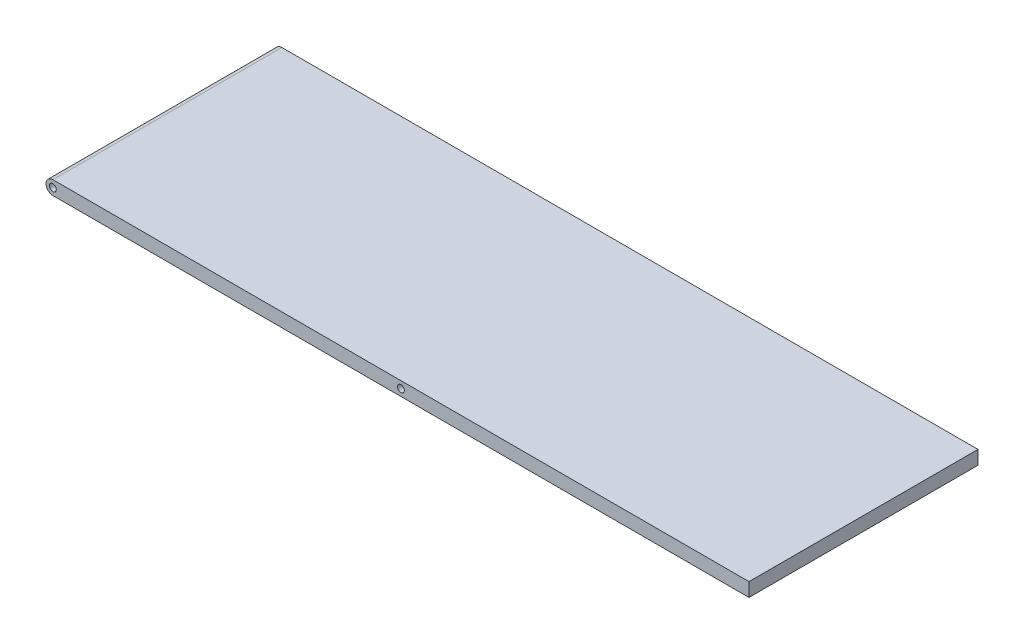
ISO-10303-21;
HEADER;
FILE_DESCRIPTION(('STEP AP214'),'2;1');
FILE_NAME('part.step','',(''),(''),'','','');
FILE_SCHEMA(('AUTOMOTIVE_DESIGN { 1 0 10303 214 1 1 1 1 }'));
ENDSEC;
DATA;
#1=APPLICATION_CONTEXT('core data for automotive mechanical design processes');
#2=APPLICATION_PROTOCOL_DEFINITION('international standard','automotive_design',2000,#1);
#3=PRODUCT_CONTEXT('',#1,'mechanical');
#4=PRODUCT('Part','Part','',(#3));
#5=PRODUCT_RELATED_PRODUCT_CATEGORY('part','',(#4));
#6=PRODUCT_DEFINITION_FORMATION('','',#4);
#7=PRODUCT_DEFINITION_CONTEXT('part definition',#1,'design');
#8=PRODUCT_DEFINITION('design','',#6,#7);
#9=PRODUCT_DEFINITION_SHAPE('','',#8);
#10=(LENGTH_UNIT() NAMED_UNIT(*) SI_UNIT(.MILLI.,.METRE.));
#11=(NAMED_UNIT(*) PLANE_ANGLE_UNIT() SI_UNIT($,.RADIAN.));
#12=(NAMED_UNIT(*) SI_UNIT($,.STERADIAN.) SOLID_ANGLE_UNIT());
#13=UNCERTAINTY_MEASURE_WITH_UNIT(LENGTH_MEASURE(1.E-05),#10,'distance_accuracy_value','');
#14=(GEOMETRIC_REPRESENTATION_CONTEXT(3) GLOBAL_UNCERTAINTY_ASSIGNED_CONTEXT((#13)) GLOBAL_UNIT_ASSIGNED_CONTEXT((#10,
#11,#12)) REPRESENTATION_CONTEXT('',''));
#15=CARTESIAN_POINT('',(0.,0.,0.));
#16=DIRECTION('',(0.,0.,1.));
#17=DIRECTION('',(1.,0.,0.));
#18=AXIS2_PLACEMENT_3D('',#15,#16,#17);
#19=CARTESIAN_POINT('',(152.,1.5,50.));
#20=DIRECTION('',(-1.,0.,0.));
#21=DIRECTION('',(0.,-1.,0.));
#22=AXIS2_PLACEMENT_3D('',#19,#20,#21);
#23=PLANE('',#22);
#24=DIRECTION('',(0.,1.,0.));
#25=VECTOR('',#24,1.);
#26=CARTESIAN_POINT('',(152.,1.5,0.));
#27=LINE('',#26,#25);
#28=CARTESIAN_POINT('',(152.,-1.50000000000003,0.));
#29=VERTEX_POINT('',#28);
#30=CARTESIAN_POINT('',(152.,1.5,0.));
#31=VERTEX_POINT('',#30);
#32=EDGE_CURVE('E75',#29,#31,#27,.T.);
#33=ORIENTED_EDGE('',*,*,#32,.T.);
#34=DIRECTION('',(0.,0.,-1.));
#35=VECTOR('',#34,1.);
#36=CARTESIAN_POINT('',(152.,1.5,50.));
#37=LINE('',#36,#35);
#38=CARTESIAN_POINT('',(152.,1.5,50.));
#39=VERTEX_POINT('',#38);
#40=EDGE_CURVE('E11',#39,#31,#37,.T.);
#41=ORIENTED_EDGE('',*,*,#40,.F.);
#42=DIRECTION('',(0.,1.,0.));
#43=VECTOR('',#42,1.);
#44=CARTESIAN_POINT('',(152.,1.5,50.));
#45=LINE('',#44,#43);
#46=CARTESIAN_POINT('',(152.,-1.50000000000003,50.));
#47=VERTEX_POINT('',#46);
#48=EDGE_CURVE('E98',#47,#39,#45,.T.);
#49=ORIENTED_EDGE('',*,*,#48,.F.);
#50=DIRECTION('',(0.,0.,-1.));
#51=VECTOR('',#50,1.);
#52=CARTESIAN_POINT('',(152.,-1.50000000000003,50.));
#53=LINE('',#52,#51);
#54=EDGE_CURVE('E87',#47,#29,#53,.T.);
#55=ORIENTED_EDGE('',*,*,#54,.T.);
#56=EDGE_LOOP('',(#33,#41,#49,#55));
#57=FACE_BOUND('',#56,.T.);
#58=ADVANCED_FACE('F31',(#57),#23,.F.);
#59=CARTESIAN_POINT('',(0.,1.5,50.));
#60=DIRECTION('',(0.,-1.,0.));
#61=DIRECTION('',(0.,0.,-1.));
#62=AXIS2_PLACEMENT_3D('',#59,#60,#61);
#63=PLANE('',#62);
#64=DIRECTION('',(-1.,0.,0.));
#65=VECTOR('',#64,1.);
#66=CARTESIAN_POINT('',(0.,1.5,0.));
#67=LINE('',#66,#65);
#68=CARTESIAN_POINT('',(0.,1.5,0.));
#69=VERTEX_POINT('',#68);
#70=EDGE_CURVE('E71',#31,#69,#67,.T.);
#71=ORIENTED_EDGE('',*,*,#70,.T.);
#72=DIRECTION('',(0.,0.,-1.));
#73=VECTOR('',#72,1.);
#74=CARTESIAN_POINT('',(0.,1.5,50.));
#75=LINE('',#74,#73);
#76=CARTESIAN_POINT('',(0.,1.5,50.));
#77=VERTEX_POINT('',#76);
#78=EDGE_CURVE('E38',#77,#69,#75,.T.);
#79=ORIENTED_EDGE('',*,*,#78,.F.);
#80=DIRECTION('',(-1.,0.,0.));
#81=VECTOR('',#80,1.);
#82=CARTESIAN_POINT('',(0.,1.5,50.));
#83=LINE('',#82,#81);
#84=EDGE_CURVE('E83',#39,#77,#83,.T.);
#85=ORIENTED_EDGE('',*,*,#84,.F.);
#86=ORIENTED_EDGE('',*,*,#40,.T.);
#87=EDGE_LOOP('',(#71,#79,#85,#86));
#88=FACE_BOUND('',#87,.T.);
#89=ADVANCED_FACE('F82',(#88),#63,.F.);
#90=CARTESIAN_POINT('',(0.,0.,50.));
#91=DIRECTION('',(0.,0.,-1.));
#92=DIRECTION('',(-1.,0.,0.));
#93=AXIS2_PLACEMENT_3D('',#90,#91,#92);
#94=CYLINDRICAL_SURFACE('',#93,1.5);
#95=CARTESIAN_POINT('',(0.,0.,0.));
#96=DIRECTION('',(0.,0.,1.));
#97=DIRECTION('',(1.,0.,0.));
#98=AXIS2_PLACEMENT_3D('',#95,#96,#97);
#99=CIRCLE('',#98,1.5);
#100=CARTESIAN_POINT('',(0.,-1.5,0.));
#101=VERTEX_POINT('',#100);
#102=EDGE_CURVE('E76',#69,#101,#99,.T.);
#103=ORIENTED_EDGE('',*,*,#102,.T.);
#104=DIRECTION('',(0.,0.,-1.));
#105=VECTOR('',#104,1.);
#106=CARTESIAN_POINT('',(0.,-1.5,50.));
#107=LINE('',#106,#105);
#108=CARTESIAN_POINT('',(0.,-1.5,50.));
#109=VERTEX_POINT('',#108);
#110=EDGE_CURVE('E104',#109,#101,#107,.T.);
#111=ORIENTED_EDGE('',*,*,#110,.F.);
#112=CARTESIAN_POINT('',(0.,0.,50.));
#113=DIRECTION('',(0.,0.,1.));
#114=DIRECTION('',(1.,0.,0.));
#115=AXIS2_PLACEMENT_3D('',#112,#113,#114);
#116=CIRCLE('',#115,1.5);
#117=EDGE_CURVE('E50',#77,#109,#116,.T.);
#118=ORIENTED_EDGE('',*,*,#117,.F.);
#119=ORIENTED_EDGE('',*,*,#78,.T.);
#120=EDGE_LOOP('',(#103,#111,#118,#119));
#121=FACE_BOUND('',#120,.T.);
#122=ADVANCED_FACE('F107',(#121),#94,.T.);
#123=CARTESIAN_POINT('',(0.,-1.5,50.));
#124=DIRECTION('',(0.,1.,0.));
#125=DIRECTION('',(-1.,0.,0.));
#126=AXIS2_PLACEMENT_3D('',#123,#124,#125);
#127=PLANE('',#126);
#128=DIRECTION('',(1.,0.,0.));
#129=VECTOR('',#128,1.);
#130=CARTESIAN_POINT('',(0.,-1.5,0.));
#131=LINE('',#130,#129);
#132=EDGE_CURVE('E96',#101,#29,#131,.T.);
#133=ORIENTED_EDGE('',*,*,#132,.T.);
#134=ORIENTED_EDGE('',*,*,#54,.F.);
#135=DIRECTION('',(1.,0.,0.));
#136=VECTOR('',#135,1.);
#137=CARTESIAN_POINT('',(0.,-1.5,50.));
#138=LINE('',#137,#136);
#139=EDGE_CURVE('E45',#109,#47,#138,.T.);
#140=ORIENTED_EDGE('',*,*,#139,.F.);
#141=ORIENTED_EDGE('',*,*,#110,.T.);
#142=EDGE_LOOP('',(#133,#134,#140,#141));
#143=FACE_BOUND('',#142,.T.);
#144=ADVANCED_FACE('F109',(#143),#127,.F.);
#145=CARTESIAN_POINT('',(0.,0.,50.));
#146=DIRECTION('',(0.,0.,1.));
#147=DIRECTION('',(1.,0.,0.));
#148=AXIS2_PLACEMENT_3D('',#145,#146,#147);
#149=PLANE('',#148);
#150=CARTESIAN_POINT('',(76.,0.,50.));
#151=DIRECTION('',(0.,0.,1.));
#152=DIRECTION('',(1.,0.,0.));
#153=AXIS2_PLACEMENT_3D('',#150,#151,#152);
#154=CIRCLE('',#153,0.749999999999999);
#155=CARTESIAN_POINT('',(76.75,0.,50.));
#156=VERTEX_POINT('',#155);
#157=EDGE_CURVE('E193',#156,#156,#154,.T.);
#158=ORIENTED_EDGE('',*,*,#157,.F.);
#159=EDGE_LOOP('',(#158));
#160=FACE_BOUND('',#159,.T.);
#161=CARTESIAN_POINT('',(0.,0.,50.));
#162=DIRECTION('',(0.,0.,1.));
#163=DIRECTION('',(1.,0.,0.));
#164=AXIS2_PLACEMENT_3D('',#161,#162,#163);
#165=CIRCLE('',#164,0.75);
#166=CARTESIAN_POINT('',(0.75,0.,50.));
#167=VERTEX_POINT('',#166);
#168=EDGE_CURVE('E91',#167,#167,#165,.T.);
#169=ORIENTED_EDGE('',*,*,#168,.F.);
#170=EDGE_LOOP('',(#169));
#171=FACE_BOUND('',#170,.T.);
#172=ORIENTED_EDGE('',*,*,#48,.T.);
#173=ORIENTED_EDGE('',*,*,#84,.T.);
#174=ORIENTED_EDGE('',*,*,#117,.T.);
#175=ORIENTED_EDGE('',*,*,#139,.T.);
#176=EDGE_LOOP('',(#172,#173,#174,#175));
#177=FACE_BOUND('',#176,.T.);
#178=ADVANCED_FACE('F110',(#160,#171,#177),#149,.T.);
#179=CARTESIAN_POINT('',(0.,0.,0.));
#180=DIRECTION('',(0.,0.,1.));
#181=DIRECTION('',(1.,0.,0.));
#182=AXIS2_PLACEMENT_3D('',#179,#180,#181);
#183=PLANE('',#182);
#184=ORIENTED_EDGE('',*,*,#32,.F.);
#185=ORIENTED_EDGE('',*,*,#132,.F.);
#186=ORIENTED_EDGE('',*,*,#102,.F.);
#187=ORIENTED_EDGE('',*,*,#70,.F.);
#188=EDGE_LOOP('',(#184,#185,#186,#187));
#189=FACE_BOUND('',#188,.T.);
#190=ADVANCED_FACE('F72',(#189),#183,.F.);
#191=CARTESIAN_POINT('',(0.,0.,40.));
#192=DIRECTION('',(0.,0.,1.));
#193=DIRECTION('',(1.,0.,0.));
#194=AXIS2_PLACEMENT_3D('',#191,#192,#193);
#195=CYLINDRICAL_SURFACE('',#194,0.75);
#196=CARTESIAN_POINT('',(0.,0.,40.));
#197=DIRECTION('',(0.,0.,1.));
#198=DIRECTION('',(1.,0.,0.));
#199=AXIS2_PLACEMENT_3D('',#196,#197,#198);
#200=CIRCLE('',#199,0.75);
#201=CARTESIAN_POINT('',(0.75,0.,40.));
#202=VERTEX_POINT('',#201);
#203=EDGE_CURVE('E88',#202,#202,#200,.T.);
#204=ORIENTED_EDGE('',*,*,#203,.F.);
#205=EDGE_LOOP('',(#204));
#206=FACE_BOUND('',#205,.T.);
#207=ORIENTED_EDGE('',*,*,#168,.T.);
#208=EDGE_LOOP('',(#207));
#209=FACE_BOUND('',#208,.T.);
#210=ADVANCED_FACE('F118',(#206,#209),#195,.F.);
#211=CARTESIAN_POINT('',(0.,0.,40.));
#212=DIRECTION('',(0.,0.,1.));
#213=DIRECTION('',(1.,0.,0.));
#214=AXIS2_PLACEMENT_3D('',#211,#212,#213);
#215=PLANE('',#214);
#216=ORIENTED_EDGE('',*,*,#203,.T.);
#217=EDGE_LOOP('',(#216));
#218=FACE_BOUND('',#217,.T.);
#219=ADVANCED_FACE('F156',(#218),#215,.T.);
#220=CARTESIAN_POINT('',(76.,0.,40.));
#221=DIRECTION('',(0.,0.,1.));
#222=DIRECTION('',(1.,0.,0.));
#223=AXIS2_PLACEMENT_3D('',#220,#221,#222);
#224=CYLINDRICAL_SURFACE('',#223,0.749999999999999);
#225=CARTESIAN_POINT('',(76.,0.,40.));
#226=DIRECTION('',(0.,0.,1.));
#227=DIRECTION('',(1.,0.,0.));
#228=AXIS2_PLACEMENT_3D('',#225,#226,#227);
#229=CIRCLE('',#228,0.749999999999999);
#230=CARTESIAN_POINT('',(76.75,0.,40.));
#231=VERTEX_POINT('',#230);
#232=EDGE_CURVE('E192',#231,#231,#229,.T.);
#233=ORIENTED_EDGE('',*,*,#232,.F.);
#234=EDGE_LOOP('',(#233));
#235=FACE_BOUND('',#234,.T.);
#236=ORIENTED_EDGE('',*,*,#157,.T.);
#237=EDGE_LOOP('',(#236));
#238=FACE_BOUND('',#237,.T.);
#239=ADVANCED_FACE('F166',(#235,#238),#224,.F.);
#240=CARTESIAN_POINT('',(76.,0.,40.));
#241=DIRECTION('',(0.,0.,1.));
#242=DIRECTION('',(1.,0.,0.));
#243=AXIS2_PLACEMENT_3D('',#240,#241,#242);
#244=PLANE('',#243);
#245=ORIENTED_EDGE('',*,*,#232,.T.);
#246=EDGE_LOOP('',(#245));
#247=FACE_BOUND('',#246,.T.);
#248=ADVANCED_FACE('F176',(#247),#244,.T.);
#249=CLOSED_SHELL('',(#58,#89,#122,#144,#178,#190,#210,#219,#239,#248));
#250=MANIFOLD_SOLID_BREP('B2',#249);
#251=ADVANCED_BREP_SHAPE_REPRESENTATION('',(#18,#250),#14);
#252=SHAPE_DEFINITION_REPRESENTATION(#9,#251);
ENDSEC;
END-ISO-10303-21;
